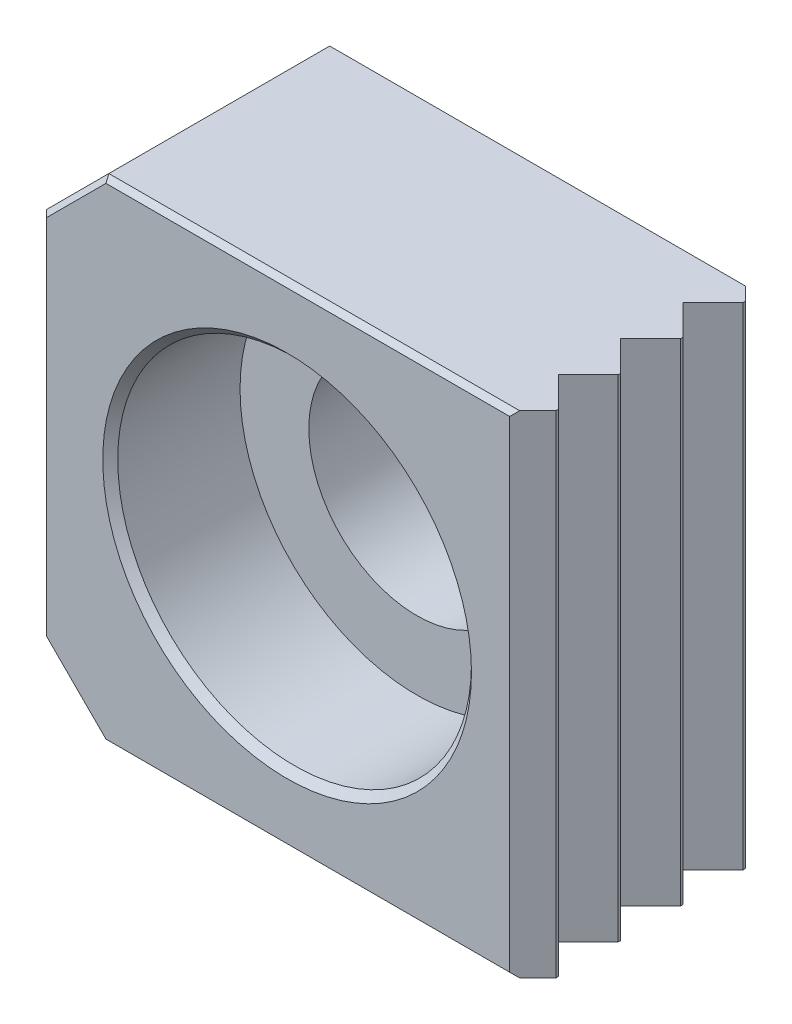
ISO-10303-21;
HEADER;
FILE_DESCRIPTION(('STEP AP214'),'2;1');
FILE_NAME('part.step','',(''),(''),'','','');
FILE_SCHEMA(('AUTOMOTIVE_DESIGN { 1 0 10303 214 1 1 1 1 }'));
ENDSEC;
DATA;
#1=APPLICATION_CONTEXT('core data for automotive mechanical design processes');
#2=APPLICATION_PROTOCOL_DEFINITION('international standard','automotive_design',2000,#1);
#3=PRODUCT_CONTEXT('',#1,'mechanical');
#4=PRODUCT('Part','Part','',(#3));
#5=PRODUCT_RELATED_PRODUCT_CATEGORY('part','',(#4));
#6=PRODUCT_DEFINITION_FORMATION('','',#4);
#7=PRODUCT_DEFINITION_CONTEXT('part definition',#1,'design');
#8=PRODUCT_DEFINITION('design','',#6,#7);
#9=PRODUCT_DEFINITION_SHAPE('','',#8);
#10=(LENGTH_UNIT() NAMED_UNIT(*) SI_UNIT(.MILLI.,.METRE.));
#11=(NAMED_UNIT(*) PLANE_ANGLE_UNIT() SI_UNIT($,.RADIAN.));
#12=(NAMED_UNIT(*) SI_UNIT($,.STERADIAN.) SOLID_ANGLE_UNIT());
#13=UNCERTAINTY_MEASURE_WITH_UNIT(LENGTH_MEASURE(1.E-05),#10,'distance_accuracy_value','');
#14=(GEOMETRIC_REPRESENTATION_CONTEXT(3) GLOBAL_UNCERTAINTY_ASSIGNED_CONTEXT((#13)) GLOBAL_UNIT_ASSIGNED_CONTEXT((#10,
#11,#12)) REPRESENTATION_CONTEXT('',''));
#15=CARTESIAN_POINT('',(0.,0.,0.));
#16=DIRECTION('',(0.,0.,1.));
#17=DIRECTION('',(1.,0.,0.));
#18=AXIS2_PLACEMENT_3D('',#15,#16,#17);
#19=CARTESIAN_POINT('',(12.5,-12.5,12.));
#20=DIRECTION('',(-1.,0.,0.));
#21=DIRECTION('',(0.,-1.,0.));
#22=AXIS2_PLACEMENT_3D('',#19,#20,#21);
#23=PLANE('',#22);
#24=DIRECTION('',(0.,-1.,0.));
#25=VECTOR('',#24,1.);
#26=CARTESIAN_POINT('',(12.5,-12.5,7.524));
#27=LINE('',#26,#25);
#28=CARTESIAN_POINT('',(12.5,12.5,7.524));
#29=VERTEX_POINT('',#28);
#30=CARTESIAN_POINT('',(12.5,-12.5,7.524));
#31=VERTEX_POINT('',#30);
#32=EDGE_CURVE('E249',#29,#31,#27,.T.);
#33=ORIENTED_EDGE('',*,*,#32,.F.);
#34=DIRECTION('',(0.,0.,-1.));
#35=VECTOR('',#34,1.);
#36=CARTESIAN_POINT('',(12.5,12.5,12.));
#37=LINE('',#36,#35);
#38=CARTESIAN_POINT('',(12.5,12.5,7.651));
#39=VERTEX_POINT('',#38);
#40=EDGE_CURVE('E393',#39,#29,#37,.T.);
#41=ORIENTED_EDGE('',*,*,#40,.F.);
#42=DIRECTION('',(0.,1.,0.));
#43=VECTOR('',#42,1.);
#44=CARTESIAN_POINT('',(12.5,-12.5,7.651));
#45=LINE('',#44,#43);
#46=CARTESIAN_POINT('',(12.5,-12.5,7.651));
#47=VERTEX_POINT('',#46);
#48=EDGE_CURVE('E247',#47,#39,#45,.T.);
#49=ORIENTED_EDGE('',*,*,#48,.F.);
#50=DIRECTION('',(0.,0.,-1.));
#51=VECTOR('',#50,1.);
#52=CARTESIAN_POINT('',(12.5,-12.5,12.));
#53=LINE('',#52,#51);
#54=EDGE_CURVE('E373',#47,#31,#53,.T.);
#55=ORIENTED_EDGE('',*,*,#54,.T.);
#56=EDGE_LOOP('',(#33,#41,#49,#55));
#57=FACE_BOUND('',#56,.T.);
#58=ADVANCED_FACE('F15',(#57),#23,.F.);
#59=CARTESIAN_POINT('',(12.5,12.5,4.476));
#60=VERTEX_POINT('',#59);
#61=CARTESIAN_POINT('',(12.5,12.5,4.34900000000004));
#62=VERTEX_POINT('',#61);
#63=EDGE_CURVE('E263',#60,#62,#37,.T.);
#64=ORIENTED_EDGE('',*,*,#63,.F.);
#65=DIRECTION('',(0.,-1.,0.));
#66=VECTOR('',#65,1.);
#67=CARTESIAN_POINT('',(12.5,-12.5,4.476));
#68=LINE('',#67,#66);
#69=CARTESIAN_POINT('',(12.5,-12.5,4.476));
#70=VERTEX_POINT('',#69);
#71=EDGE_CURVE('E251',#60,#70,#68,.T.);
#72=ORIENTED_EDGE('',*,*,#71,.T.);
#73=CARTESIAN_POINT('',(12.5,-12.5,4.34900000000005));
#74=VERTEX_POINT('',#73);
#75=EDGE_CURVE('E258',#70,#74,#53,.T.);
#76=ORIENTED_EDGE('',*,*,#75,.T.);
#77=DIRECTION('',(0.,1.,0.));
#78=VECTOR('',#77,1.);
#79=CARTESIAN_POINT('',(12.5,-12.5,4.34900000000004));
#80=LINE('',#79,#78);
#81=EDGE_CURVE('E177',#74,#62,#80,.T.);
#82=ORIENTED_EDGE('',*,*,#81,.T.);
#83=EDGE_LOOP('',(#64,#72,#76,#82));
#84=FACE_BOUND('',#83,.T.);
#85=ADVANCED_FACE('F350',(#84),#23,.F.);
#86=DIRECTION('',(0.,-1.,0.));
#87=VECTOR('',#86,1.);
#88=CARTESIAN_POINT('',(12.5,-12.5,10.699));
#89=LINE('',#88,#87);
#90=CARTESIAN_POINT('',(12.5,12.5,10.699));
#91=VERTEX_POINT('',#90);
#92=CARTESIAN_POINT('',(12.5,-12.5,10.699));
#93=VERTEX_POINT('',#92);
#94=EDGE_CURVE('E245',#91,#93,#89,.T.);
#95=ORIENTED_EDGE('',*,*,#94,.F.);
#96=CARTESIAN_POINT('',(12.5,12.5,10.826));
#97=VERTEX_POINT('',#96);
#98=EDGE_CURVE('E264',#97,#91,#37,.T.);
#99=ORIENTED_EDGE('',*,*,#98,.F.);
#100=DIRECTION('',(0.,1.,0.));
#101=VECTOR('',#100,1.);
#102=CARTESIAN_POINT('',(12.5,-12.5,10.826));
#103=LINE('',#102,#101);
#104=CARTESIAN_POINT('',(12.5,-12.5,10.826));
#105=VERTEX_POINT('',#104);
#106=EDGE_CURVE('E240',#105,#97,#103,.T.);
#107=ORIENTED_EDGE('',*,*,#106,.F.);
#108=EDGE_CURVE('E259',#105,#93,#53,.T.);
#109=ORIENTED_EDGE('',*,*,#108,.T.);
#110=EDGE_LOOP('',(#95,#99,#107,#109));
#111=FACE_BOUND('',#110,.T.);
#112=ADVANCED_FACE('F356',(#111),#23,.F.);
#113=CARTESIAN_POINT('',(12.5,-12.5,1.30100000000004));
#114=VERTEX_POINT('',#113);
#115=CARTESIAN_POINT('',(12.5,-12.5,1.17400000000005));
#116=VERTEX_POINT('',#115);
#117=EDGE_CURVE('E199',#114,#116,#53,.T.);
#118=ORIENTED_EDGE('',*,*,#117,.T.);
#119=DIRECTION('',(0.,1.,0.));
#120=VECTOR('',#119,1.);
#121=CARTESIAN_POINT('',(12.5,-12.5,1.17400000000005));
#122=LINE('',#121,#120);
#123=CARTESIAN_POINT('',(12.5,12.5,1.17400000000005));
#124=VERTEX_POINT('',#123);
#125=EDGE_CURVE('E236',#116,#124,#122,.T.);
#126=ORIENTED_EDGE('',*,*,#125,.T.);
#127=CARTESIAN_POINT('',(12.5,12.5,1.30100000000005));
#128=VERTEX_POINT('',#127);
#129=EDGE_CURVE('E260',#128,#124,#37,.T.);
#130=ORIENTED_EDGE('',*,*,#129,.F.);
#131=DIRECTION('',(0.,-1.,0.));
#132=VECTOR('',#131,1.);
#133=CARTESIAN_POINT('',(12.5,-12.5,1.30100000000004));
#134=LINE('',#133,#132);
#135=EDGE_CURVE('E243',#128,#114,#134,.T.);
#136=ORIENTED_EDGE('',*,*,#135,.T.);
#137=EDGE_LOOP('',(#118,#126,#130,#136));
#138=FACE_BOUND('',#137,.T.);
#139=ADVANCED_FACE('F352',(#138),#23,.F.);
#140=CARTESIAN_POINT('',(-12.5,12.5,12.));
#141=DIRECTION('',(0.,1.,0.));
#142=DIRECTION('',(-1.,0.,0.));
#143=AXIS2_PLACEMENT_3D('',#140,#141,#142);
#144=PLANE('',#143);
#145=DIRECTION('',(0.,0.,1.));
#146=VECTOR('',#145,1.);
#147=CARTESIAN_POINT('',(-9.325,12.5,12.));
#148=LINE('',#147,#146);
#149=CARTESIAN_POINT('',(-9.325,12.5,0.508));
#150=VERTEX_POINT('',#149);
#151=CARTESIAN_POINT('',(-9.325,12.5,11.746));
#152=VERTEX_POINT('',#151);
#153=EDGE_CURVE('E277',#150,#152,#148,.T.);
#154=ORIENTED_EDGE('',*,*,#153,.T.);
#155=DIRECTION('',(1.,0.,0.));
#156=VECTOR('',#155,1.);
#157=CARTESIAN_POINT('',(-12.5,12.5,11.746));
#158=LINE('',#157,#156);
#159=CARTESIAN_POINT('',(11.58,12.5,11.746));
#160=VERTEX_POINT('',#159);
#161=EDGE_CURVE('E333',#152,#160,#158,.T.);
#162=ORIENTED_EDGE('',*,*,#161,.T.);
#163=DIRECTION('',(-0.707106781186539,0.,0.707106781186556));
#164=VECTOR('',#163,1.);
#165=CARTESIAN_POINT('',(12.5635,12.5,10.7625));
#166=LINE('',#165,#164);
#167=EDGE_CURVE('E226',#97,#160,#166,.T.);
#168=ORIENTED_EDGE('',*,*,#167,.F.);
#169=ORIENTED_EDGE('',*,*,#98,.T.);
#170=DIRECTION('',(0.707106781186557,0.,0.707106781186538));
#171=VECTOR('',#170,1.);
#172=CARTESIAN_POINT('',(10.976,12.5,9.175));
#173=LINE('',#172,#171);
#174=CARTESIAN_POINT('',(10.976,12.5,9.175));
#175=VERTEX_POINT('',#174);
#176=EDGE_CURVE('E229',#175,#91,#173,.T.);
#177=ORIENTED_EDGE('',*,*,#176,.F.);
#178=DIRECTION('',(-0.707106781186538,0.,0.707106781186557));
#179=VECTOR('',#178,1.);
#180=CARTESIAN_POINT('',(12.5635,12.5,7.5875));
#181=LINE('',#180,#179);
#182=EDGE_CURVE('E231',#39,#175,#181,.T.);
#183=ORIENTED_EDGE('',*,*,#182,.F.);
#184=ORIENTED_EDGE('',*,*,#40,.T.);
#185=DIRECTION('',(0.707106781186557,0.,0.707106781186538));
#186=VECTOR('',#185,1.);
#187=CARTESIAN_POINT('',(10.976,12.5,6.));
#188=LINE('',#187,#186);
#189=CARTESIAN_POINT('',(10.976,12.5,6.));
#190=VERTEX_POINT('',#189);
#191=EDGE_CURVE('E192',#190,#29,#188,.T.);
#192=ORIENTED_EDGE('',*,*,#191,.F.);
#193=DIRECTION('',(0.707106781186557,0.,-0.707106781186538));
#194=VECTOR('',#193,1.);
#195=CARTESIAN_POINT('',(10.976,12.5,6.));
#196=LINE('',#195,#194);
#197=EDGE_CURVE('E217',#190,#60,#196,.T.);
#198=ORIENTED_EDGE('',*,*,#197,.T.);
#199=ORIENTED_EDGE('',*,*,#63,.T.);
#200=DIRECTION('',(-0.70710678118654,0.,-0.707106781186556));
#201=VECTOR('',#200,1.);
#202=CARTESIAN_POINT('',(12.5635,12.5,4.41250000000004));
#203=LINE('',#202,#201);
#204=CARTESIAN_POINT('',(10.976,12.5,2.825));
#205=VERTEX_POINT('',#204);
#206=EDGE_CURVE('E220',#62,#205,#203,.T.);
#207=ORIENTED_EDGE('',*,*,#206,.T.);
#208=DIRECTION('',(0.707106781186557,0.,-0.707106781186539));
#209=VECTOR('',#208,1.);
#210=CARTESIAN_POINT('',(10.976,12.5,2.825));
#211=LINE('',#210,#209);
#212=EDGE_CURVE('E189',#205,#128,#211,.T.);
#213=ORIENTED_EDGE('',*,*,#212,.T.);
#214=ORIENTED_EDGE('',*,*,#129,.T.);
#215=DIRECTION('',(-0.707106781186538,0.,-0.707106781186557));
#216=VECTOR('',#215,1.);
#217=CARTESIAN_POINT('',(12.5635,12.5,1.23750000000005));
#218=LINE('',#217,#216);
#219=CARTESIAN_POINT('',(11.834,12.5,0.508));
#220=VERTEX_POINT('',#219);
#221=EDGE_CURVE('E223',#124,#220,#218,.T.);
#222=ORIENTED_EDGE('',*,*,#221,.T.);
#223=DIRECTION('',(-1.,0.,0.));
#224=VECTOR('',#223,1.);
#225=CARTESIAN_POINT('',(-9.325,12.5,0.508));
#226=LINE('',#225,#224);
#227=EDGE_CURVE('E310',#220,#150,#226,.T.);
#228=ORIENTED_EDGE('',*,*,#227,.T.);
#229=EDGE_LOOP('',(#154,#162,#168,#169,#177,#183,#184,#192,#198,#199,#207,#213,#214,#222,#228));
#230=FACE_BOUND('',#229,.T.);
#231=ADVANCED_FACE('F361',(#230),#144,.T.);
#232=CARTESIAN_POINT('',(12.5,-12.5,12.));
#233=DIRECTION('',(0.,-1.,0.));
#234=DIRECTION('',(1.,0.,0.));
#235=AXIS2_PLACEMENT_3D('',#232,#233,#234);
#236=PLANE('',#235);
#237=DIRECTION('',(-0.707106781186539,0.,0.707106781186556));
#238=VECTOR('',#237,1.);
#239=CARTESIAN_POINT('',(12.5635,-12.5,10.7625));
#240=LINE('',#239,#238);
#241=CARTESIAN_POINT('',(11.58,-12.5,11.746));
#242=VERTEX_POINT('',#241);
#243=EDGE_CURVE('E203',#105,#242,#240,.T.);
#244=ORIENTED_EDGE('',*,*,#243,.T.);
#245=DIRECTION('',(-1.,0.,0.));
#246=VECTOR('',#245,1.);
#247=CARTESIAN_POINT('',(12.5,-12.5,11.746));
#248=LINE('',#247,#246);
#249=CARTESIAN_POINT('',(-9.325,-12.5,11.746));
#250=VERTEX_POINT('',#249);
#251=EDGE_CURVE('E312',#242,#250,#248,.T.);
#252=ORIENTED_EDGE('',*,*,#251,.T.);
#253=DIRECTION('',(0.,0.,-1.));
#254=VECTOR('',#253,1.);
#255=CARTESIAN_POINT('',(-9.325,-12.5,0.));
#256=LINE('',#255,#254);
#257=CARTESIAN_POINT('',(-9.325,-12.5,0.508));
#258=VERTEX_POINT('',#257);
#259=EDGE_CURVE('E271',#250,#258,#256,.T.);
#260=ORIENTED_EDGE('',*,*,#259,.T.);
#261=DIRECTION('',(1.,0.,0.));
#262=VECTOR('',#261,1.);
#263=CARTESIAN_POINT('',(11.326,-12.5,0.508));
#264=LINE('',#263,#262);
#265=CARTESIAN_POINT('',(11.834,-12.5,0.508));
#266=VERTEX_POINT('',#265);
#267=EDGE_CURVE('E296',#258,#266,#264,.T.);
#268=ORIENTED_EDGE('',*,*,#267,.T.);
#269=DIRECTION('',(-0.707106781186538,0.,-0.707106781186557));
#270=VECTOR('',#269,1.);
#271=CARTESIAN_POINT('',(12.5635,-12.5,1.23750000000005));
#272=LINE('',#271,#270);
#273=EDGE_CURVE('E200',#116,#266,#272,.T.);
#274=ORIENTED_EDGE('',*,*,#273,.F.);
#275=ORIENTED_EDGE('',*,*,#117,.F.);
#276=DIRECTION('',(0.707106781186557,0.,-0.707106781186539));
#277=VECTOR('',#276,1.);
#278=CARTESIAN_POINT('',(10.976,-12.5,2.825));
#279=LINE('',#278,#277);
#280=CARTESIAN_POINT('',(10.976,-12.5,2.825));
#281=VERTEX_POINT('',#280);
#282=EDGE_CURVE('E182',#281,#114,#279,.T.);
#283=ORIENTED_EDGE('',*,*,#282,.F.);
#284=DIRECTION('',(-0.70710678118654,0.,-0.707106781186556));
#285=VECTOR('',#284,1.);
#286=CARTESIAN_POINT('',(12.5635,-12.5,4.41250000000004));
#287=LINE('',#286,#285);
#288=EDGE_CURVE('E171',#74,#281,#287,.T.);
#289=ORIENTED_EDGE('',*,*,#288,.F.);
#290=ORIENTED_EDGE('',*,*,#75,.F.);
#291=DIRECTION('',(0.707106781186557,0.,-0.707106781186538));
#292=VECTOR('',#291,1.);
#293=CARTESIAN_POINT('',(10.976,-12.5,6.));
#294=LINE('',#293,#292);
#295=CARTESIAN_POINT('',(10.976,-12.5,6.));
#296=VERTEX_POINT('',#295);
#297=EDGE_CURVE('E183',#296,#70,#294,.T.);
#298=ORIENTED_EDGE('',*,*,#297,.F.);
#299=DIRECTION('',(0.707106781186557,0.,0.707106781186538));
#300=VECTOR('',#299,1.);
#301=CARTESIAN_POINT('',(10.976,-12.5,6.));
#302=LINE('',#301,#300);
#303=EDGE_CURVE('E214',#296,#31,#302,.T.);
#304=ORIENTED_EDGE('',*,*,#303,.T.);
#305=ORIENTED_EDGE('',*,*,#54,.F.);
#306=DIRECTION('',(-0.707106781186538,0.,0.707106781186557));
#307=VECTOR('',#306,1.);
#308=CARTESIAN_POINT('',(12.5635,-12.5,7.5875));
#309=LINE('',#308,#307);
#310=CARTESIAN_POINT('',(10.976,-12.5,9.175));
#311=VERTEX_POINT('',#310);
#312=EDGE_CURVE('E211',#47,#311,#309,.T.);
#313=ORIENTED_EDGE('',*,*,#312,.T.);
#314=DIRECTION('',(0.707106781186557,0.,0.707106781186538));
#315=VECTOR('',#314,1.);
#316=CARTESIAN_POINT('',(10.976,-12.5,9.175));
#317=LINE('',#316,#315);
#318=EDGE_CURVE('E208',#311,#93,#317,.T.);
#319=ORIENTED_EDGE('',*,*,#318,.T.);
#320=ORIENTED_EDGE('',*,*,#108,.F.);
#321=EDGE_LOOP('',(#244,#252,#260,#268,#274,#275,#283,#289,#290,#298,#304,#305,#313,#319,#320));
#322=FACE_BOUND('',#321,.T.);
#323=ADVANCED_FACE('F196',(#322),#236,.T.);
#324=CARTESIAN_POINT('',(12.5,-12.5,12.));
#325=DIRECTION('',(0.,0.,1.));
#326=DIRECTION('',(-1.,0.,0.));
#327=AXIS2_PLACEMENT_3D('',#324,#325,#326);
#328=PLANE('',#327);
#329=CARTESIAN_POINT('',(0.,0.,12.));
#330=DIRECTION('',(0.,0.,1.));
#331=DIRECTION('',(1.,0.,0.));
#332=AXIS2_PLACEMENT_3D('',#329,#330,#331);
#333=CIRCLE('',#332,9.381);
#334=CARTESIAN_POINT('',(9.381,0.,12.));
#335=VERTEX_POINT('',#334);
#336=EDGE_CURVE('E9',#335,#335,#333,.F.);
#337=ORIENTED_EDGE('',*,*,#336,.T.);
#338=EDGE_LOOP('',(#337));
#339=FACE_BOUND('',#338,.T.);
#340=DIRECTION('',(0.707106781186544,-0.707106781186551,0.));
#341=VECTOR('',#340,1.);
#342=CARTESIAN_POINT('',(1.76710512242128,-23.2328948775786,12.));
#343=LINE('',#342,#341);
#344=CARTESIAN_POINT('',(-12.246,-9.21978975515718,12.));
#345=VERTEX_POINT('',#344);
#346=CARTESIAN_POINT('',(-9.21978975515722,-12.246,12.));
#347=VERTEX_POINT('',#346);
#348=EDGE_CURVE('E321',#345,#347,#343,.T.);
#349=ORIENTED_EDGE('',*,*,#348,.T.);
#350=DIRECTION('',(1.,0.,0.));
#351=VECTOR('',#350,1.);
#352=CARTESIAN_POINT('',(12.5,-12.246,12.));
#353=LINE('',#352,#351);
#354=CARTESIAN_POINT('',(11.326,-12.246,12.));
#355=VERTEX_POINT('',#354);
#356=EDGE_CURVE('E323',#347,#355,#353,.T.);
#357=ORIENTED_EDGE('',*,*,#356,.T.);
#358=DIRECTION('',(0.,1.,0.));
#359=VECTOR('',#358,1.);
#360=CARTESIAN_POINT('',(11.326,-12.5,12.));
#361=LINE('',#360,#359);
#362=CARTESIAN_POINT('',(11.326,12.246,12.));
#363=VERTEX_POINT('',#362);
#364=EDGE_CURVE('E268',#355,#363,#361,.T.);
#365=ORIENTED_EDGE('',*,*,#364,.T.);
#366=DIRECTION('',(-1.,0.,0.));
#367=VECTOR('',#366,1.);
#368=CARTESIAN_POINT('',(12.5,12.246,12.));
#369=LINE('',#368,#367);
#370=CARTESIAN_POINT('',(-9.21978975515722,12.246,12.));
#371=VERTEX_POINT('',#370);
#372=EDGE_CURVE('E315',#363,#371,#369,.T.);
#373=ORIENTED_EDGE('',*,*,#372,.T.);
#374=DIRECTION('',(-0.707106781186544,-0.707106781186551,0.));
#375=VECTOR('',#374,1.);
#376=CARTESIAN_POINT('',(-10.7328948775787,10.7328948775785,12.));
#377=LINE('',#376,#375);
#378=CARTESIAN_POINT('',(-12.246,9.21978975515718,12.));
#379=VERTEX_POINT('',#378);
#380=EDGE_CURVE('E317',#371,#379,#377,.T.);
#381=ORIENTED_EDGE('',*,*,#380,.T.);
#382=DIRECTION('',(0.,-1.,0.));
#383=VECTOR('',#382,1.);
#384=CARTESIAN_POINT('',(-12.246,-9.325,12.));
#385=LINE('',#384,#383);
#386=EDGE_CURVE('E319',#379,#345,#385,.T.);
#387=ORIENTED_EDGE('',*,*,#386,.T.);
#388=EDGE_LOOP('',(#349,#357,#365,#373,#381,#387));
#389=FACE_BOUND('',#388,.T.);
#390=ADVANCED_FACE('F445',(#339,#389),#328,.T.);
#391=CARTESIAN_POINT('',(-12.5,12.5,12.));
#392=DIRECTION('',(1.,0.,0.));
#393=DIRECTION('',(0.,1.,0.));
#394=AXIS2_PLACEMENT_3D('',#391,#392,#393);
#395=PLANE('',#394);
#396=DIRECTION('',(0.,0.,1.));
#397=VECTOR('',#396,1.);
#398=CARTESIAN_POINT('',(-12.5,-9.325,12.));
#399=LINE('',#398,#397);
#400=CARTESIAN_POINT('',(-12.5,-9.325,0.508));
#401=VERTEX_POINT('',#400);
#402=CARTESIAN_POINT('',(-12.5,-9.325,11.746));
#403=VERTEX_POINT('',#402);
#404=EDGE_CURVE('E275',#401,#403,#399,.T.);
#405=ORIENTED_EDGE('',*,*,#404,.T.);
#406=DIRECTION('',(0.,1.,0.));
#407=VECTOR('',#406,1.);
#408=CARTESIAN_POINT('',(-12.5,9.325,11.746));
#409=LINE('',#408,#407);
#410=CARTESIAN_POINT('',(-12.5,9.325,11.746));
#411=VERTEX_POINT('',#410);
#412=EDGE_CURVE('E38',#403,#411,#409,.T.);
#413=ORIENTED_EDGE('',*,*,#412,.T.);
#414=DIRECTION('',(0.,0.,-1.));
#415=VECTOR('',#414,1.);
#416=CARTESIAN_POINT('',(-12.5,9.325,0.));
#417=LINE('',#416,#415);
#418=CARTESIAN_POINT('',(-12.5,9.325,0.508));
#419=VERTEX_POINT('',#418);
#420=EDGE_CURVE('E273',#411,#419,#417,.T.);
#421=ORIENTED_EDGE('',*,*,#420,.T.);
#422=DIRECTION('',(0.,-1.,0.));
#423=VECTOR('',#422,1.);
#424=CARTESIAN_POINT('',(-12.5,12.5,0.508));
#425=LINE('',#424,#423);
#426=EDGE_CURVE('E305',#419,#401,#425,.T.);
#427=ORIENTED_EDGE('',*,*,#426,.T.);
#428=EDGE_LOOP('',(#405,#413,#421,#427));
#429=FACE_BOUND('',#428,.T.);
#430=ADVANCED_FACE('F439',(#429),#395,.F.);
#431=CARTESIAN_POINT('',(12.5,-12.5,0.));
#432=DIRECTION('',(0.,0.,1.));
#433=DIRECTION('',(-1.,0.,0.));
#434=AXIS2_PLACEMENT_3D('',#431,#432,#433);
#435=PLANE('',#434);
#436=CARTESIAN_POINT('',(0.,0.,0.));
#437=DIRECTION('',(0.,0.,1.));
#438=DIRECTION('',(-1.,0.,0.));
#439=AXIS2_PLACEMENT_3D('',#436,#437,#438);
#440=CIRCLE('',#439,5.881);
#441=CARTESIAN_POINT('',(-5.881,0.,0.));
#442=VERTEX_POINT('',#441);
#443=EDGE_CURVE('E279',#442,#442,#440,.T.);
#444=ORIENTED_EDGE('',*,*,#443,.T.);
#445=EDGE_LOOP('',(#444));
#446=FACE_BOUND('',#445,.T.);
#447=DIRECTION('',(0.,-1.,0.));
#448=VECTOR('',#447,1.);
#449=CARTESIAN_POINT('',(11.326,-12.5,0.));
#450=LINE('',#449,#448);
#451=CARTESIAN_POINT('',(11.326,11.992,0.));
#452=VERTEX_POINT('',#451);
#453=CARTESIAN_POINT('',(11.326,-11.992,0.));
#454=VERTEX_POINT('',#453);
#455=EDGE_CURVE('E265',#452,#454,#450,.T.);
#456=ORIENTED_EDGE('',*,*,#455,.T.);
#457=DIRECTION('',(-1.,0.,0.));
#458=VECTOR('',#457,1.);
#459=CARTESIAN_POINT('',(-9.325,-11.992,0.));
#460=LINE('',#459,#458);
#461=CARTESIAN_POINT('',(-9.11457951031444,-11.992,0.));
#462=VERTEX_POINT('',#461);
#463=EDGE_CURVE('E293',#454,#462,#460,.T.);
#464=ORIENTED_EDGE('',*,*,#463,.T.);
#465=DIRECTION('',(-0.707106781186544,0.707106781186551,0.));
#466=VECTOR('',#465,1.);
#467=CARTESIAN_POINT('',(-12.1407897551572,-8.96578975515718,0.));
#468=LINE('',#467,#466);
#469=CARTESIAN_POINT('',(-11.992,-9.11457951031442,0.));
#470=VERTEX_POINT('',#469);
#471=EDGE_CURVE('E291',#462,#470,#468,.T.);
#472=ORIENTED_EDGE('',*,*,#471,.T.);
#473=DIRECTION('',(0.,1.,0.));
#474=VECTOR('',#473,1.);
#475=CARTESIAN_POINT('',(-11.992,-12.5,0.));
#476=LINE('',#475,#474);
#477=CARTESIAN_POINT('',(-11.992,9.11457951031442,0.));
#478=VERTEX_POINT('',#477);
#479=EDGE_CURVE('E289',#470,#478,#476,.T.);
#480=ORIENTED_EDGE('',*,*,#479,.T.);
#481=DIRECTION('',(0.707106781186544,0.707106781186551,0.));
#482=VECTOR('',#481,1.);
#483=CARTESIAN_POINT('',(-8.96578975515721,12.1407897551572,0.));
#484=LINE('',#483,#482);
#485=CARTESIAN_POINT('',(-9.11457951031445,11.992,0.));
#486=VERTEX_POINT('',#485);
#487=EDGE_CURVE('E287',#478,#486,#484,.T.);
#488=ORIENTED_EDGE('',*,*,#487,.T.);
#489=DIRECTION('',(1.,0.,0.));
#490=VECTOR('',#489,1.);
#491=CARTESIAN_POINT('',(11.326,11.992,0.));
#492=LINE('',#491,#490);
#493=EDGE_CURVE('E285',#486,#452,#492,.T.);
#494=ORIENTED_EDGE('',*,*,#493,.T.);
#495=EDGE_LOOP('',(#456,#464,#472,#480,#488,#494));
#496=FACE_BOUND('',#495,.T.);
#497=ADVANCED_FACE('F429',(#446,#496),#435,.F.);
#498=CARTESIAN_POINT('',(0.,0.,5.396));
#499=DIRECTION('',(0.,0.,1.));
#500=DIRECTION('',(-1.,0.,0.));
#501=AXIS2_PLACEMENT_3D('',#498,#499,#500);
#502=PLANE('',#501);
#503=CARTESIAN_POINT('',(0.,0.,5.396));
#504=DIRECTION('',(0.,0.,1.));
#505=DIRECTION('',(-1.,0.,0.));
#506=AXIS2_PLACEMENT_3D('',#503,#504,#505);
#507=CIRCLE('',#506,5.5);
#508=CARTESIAN_POINT('',(-5.5,0.,5.396));
#509=VERTEX_POINT('',#508);
#510=EDGE_CURVE('E254',#509,#509,#507,.T.);
#511=ORIENTED_EDGE('',*,*,#510,.F.);
#512=EDGE_LOOP('',(#511));
#513=FACE_BOUND('',#512,.T.);
#514=CARTESIAN_POINT('',(0.,0.,5.396));
#515=DIRECTION('',(0.,0.,1.));
#516=DIRECTION('',(1.,0.,0.));
#517=AXIS2_PLACEMENT_3D('',#514,#515,#516);
#518=CIRCLE('',#517,9.);
#519=CARTESIAN_POINT('',(9.,0.,5.396));
#520=VERTEX_POINT('',#519);
#521=EDGE_CURVE('E422',#520,#520,#518,.F.);
#522=ORIENTED_EDGE('',*,*,#521,.F.);
#523=EDGE_LOOP('',(#522));
#524=FACE_BOUND('',#523,.T.);
#525=ADVANCED_FACE('F426',(#513,#524),#502,.T.);
#526=CARTESIAN_POINT('',(0.,0.,0.));
#527=DIRECTION('',(0.,0.,1.));
#528=DIRECTION('',(-1.,0.,0.));
#529=AXIS2_PLACEMENT_3D('',#526,#527,#528);
#530=CYLINDRICAL_SURFACE('',#529,5.5);
#531=CARTESIAN_POINT('',(0.,0.,0.381));
#532=DIRECTION('',(0.,0.,1.));
#533=DIRECTION('',(-1.,0.,0.));
#534=AXIS2_PLACEMENT_3D('',#531,#532,#533);
#535=CIRCLE('',#534,5.5);
#536=CARTESIAN_POINT('',(-5.5,0.,0.381));
#537=VERTEX_POINT('',#536);
#538=EDGE_CURVE('E282',#537,#537,#535,.F.);
#539=ORIENTED_EDGE('',*,*,#538,.T.);
#540=EDGE_LOOP('',(#539));
#541=FACE_BOUND('',#540,.T.);
#542=ORIENTED_EDGE('',*,*,#510,.T.);
#543=EDGE_LOOP('',(#542));
#544=FACE_BOUND('',#543,.T.);
#545=ADVANCED_FACE('F428',(#541,#544),#530,.F.);
#546=CARTESIAN_POINT('',(12.5635,12.5,1.23750000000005));
#547=DIRECTION('',(-0.707106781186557,0.,0.707106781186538));
#548=DIRECTION('',(-0.707106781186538,0.,-0.707106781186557));
#549=AXIS2_PLACEMENT_3D('',#546,#547,#548);
#550=PLANE('',#549);
#551=ORIENTED_EDGE('',*,*,#273,.T.);
#552=DIRECTION('',(-0.577350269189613,0.577350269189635,-0.577350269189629));
#553=VECTOR('',#552,1.);
#554=CARTESIAN_POINT('',(11.7173333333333,-12.3833333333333,0.391333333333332));
#555=LINE('',#554,#553);
#556=EDGE_CURVE('E300',#266,#454,#555,.T.);
#557=ORIENTED_EDGE('',*,*,#556,.T.);
#558=ORIENTED_EDGE('',*,*,#455,.F.);
#559=DIRECTION('',(0.577350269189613,0.577350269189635,0.577350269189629));
#560=VECTOR('',#559,1.);
#561=CARTESIAN_POINT('',(11.7173333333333,12.3833333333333,0.39133333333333));
#562=LINE('',#561,#560);
#563=EDGE_CURVE('E298',#452,#220,#562,.T.);
#564=ORIENTED_EDGE('',*,*,#563,.T.);
#565=ORIENTED_EDGE('',*,*,#221,.F.);
#566=ORIENTED_EDGE('',*,*,#125,.F.);
#567=EDGE_LOOP('',(#551,#557,#558,#564,#565,#566));
#568=FACE_BOUND('',#567,.T.);
#569=ADVANCED_FACE('F436',(#568),#550,.F.);
#570=CARTESIAN_POINT('',(12.5635,12.5,10.7625));
#571=DIRECTION('',(0.707106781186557,0.,0.707106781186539));
#572=DIRECTION('',(-0.707106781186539,0.,0.707106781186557));
#573=AXIS2_PLACEMENT_3D('',#570,#571,#572);
#574=PLANE('',#573);
#575=ORIENTED_EDGE('',*,*,#364,.F.);
#576=DIRECTION('',(-0.577350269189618,0.577350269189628,0.577350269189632));
#577=VECTOR('',#576,1.);
#578=CARTESIAN_POINT('',(3.90233333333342,-4.82233333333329,19.4236666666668));
#579=LINE('',#578,#577);
#580=EDGE_CURVE('E327',#355,#242,#579,.F.);
#581=ORIENTED_EDGE('',*,*,#580,.T.);
#582=ORIENTED_EDGE('',*,*,#243,.F.);
#583=ORIENTED_EDGE('',*,*,#106,.T.);
#584=ORIENTED_EDGE('',*,*,#167,.T.);
#585=DIRECTION('',(0.577350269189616,0.577350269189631,-0.577350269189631));
#586=VECTOR('',#585,1.);
#587=CARTESIAN_POINT('',(12.2356666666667,13.1556666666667,11.0903333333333));
#588=LINE('',#587,#586);
#589=EDGE_CURVE('E325',#160,#363,#588,.F.);
#590=ORIENTED_EDGE('',*,*,#589,.T.);
#591=EDGE_LOOP('',(#575,#581,#582,#583,#584,#590));
#592=FACE_BOUND('',#591,.T.);
#593=ADVANCED_FACE('F474',(#592),#574,.T.);
#594=CARTESIAN_POINT('',(12.5635,12.5,4.41250000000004));
#595=DIRECTION('',(-0.707106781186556,0.,0.707106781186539));
#596=DIRECTION('',(-0.70710678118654,0.,-0.707106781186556));
#597=AXIS2_PLACEMENT_3D('',#594,#595,#596);
#598=PLANE('',#597);
#599=ORIENTED_EDGE('',*,*,#288,.T.);
#600=DIRECTION('',(0.,-1.,0.));
#601=VECTOR('',#600,1.);
#602=CARTESIAN_POINT('',(10.976,12.5,2.825));
#603=LINE('',#602,#601);
#604=EDGE_CURVE('E174',#205,#281,#603,.T.);
#605=ORIENTED_EDGE('',*,*,#604,.F.);
#606=ORIENTED_EDGE('',*,*,#206,.F.);
#607=ORIENTED_EDGE('',*,*,#81,.F.);
#608=EDGE_LOOP('',(#599,#605,#606,#607));
#609=FACE_BOUND('',#608,.T.);
#610=ADVANCED_FACE('F173',(#609),#598,.F.);
#611=CARTESIAN_POINT('',(10.976,12.5,2.825));
#612=DIRECTION('',(-0.707106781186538,0.,-0.707106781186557));
#613=DIRECTION('',(0.707106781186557,0.,-0.707106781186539));
#614=AXIS2_PLACEMENT_3D('',#611,#612,#613);
#615=PLANE('',#614);
#616=ORIENTED_EDGE('',*,*,#212,.F.);
#617=ORIENTED_EDGE('',*,*,#604,.T.);
#618=ORIENTED_EDGE('',*,*,#282,.T.);
#619=ORIENTED_EDGE('',*,*,#135,.F.);
#620=EDGE_LOOP('',(#616,#617,#618,#619));
#621=FACE_BOUND('',#620,.T.);
#622=ADVANCED_FACE('F186',(#621),#615,.F.);
#623=CARTESIAN_POINT('',(10.976,12.5,9.175));
#624=DIRECTION('',(0.707106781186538,0.,-0.707106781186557));
#625=DIRECTION('',(0.707106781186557,0.,0.707106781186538));
#626=AXIS2_PLACEMENT_3D('',#623,#624,#625);
#627=PLANE('',#626);
#628=ORIENTED_EDGE('',*,*,#94,.T.);
#629=ORIENTED_EDGE('',*,*,#318,.F.);
#630=DIRECTION('',(0.,-1.,0.));
#631=VECTOR('',#630,1.);
#632=CARTESIAN_POINT('',(10.976,12.5,9.175));
#633=LINE('',#632,#631);
#634=EDGE_CURVE('E191',#175,#311,#633,.T.);
#635=ORIENTED_EDGE('',*,*,#634,.F.);
#636=ORIENTED_EDGE('',*,*,#176,.T.);
#637=EDGE_LOOP('',(#628,#629,#635,#636));
#638=FACE_BOUND('',#637,.T.);
#639=ADVANCED_FACE('F387',(#638),#627,.T.);
#640=CARTESIAN_POINT('',(12.5635,12.5,7.5875));
#641=DIRECTION('',(0.707106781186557,0.,0.707106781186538));
#642=DIRECTION('',(-0.707106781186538,0.,0.707106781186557));
#643=AXIS2_PLACEMENT_3D('',#640,#641,#642);
#644=PLANE('',#643);
#645=ORIENTED_EDGE('',*,*,#48,.T.);
#646=ORIENTED_EDGE('',*,*,#182,.T.);
#647=ORIENTED_EDGE('',*,*,#634,.T.);
#648=ORIENTED_EDGE('',*,*,#312,.F.);
#649=EDGE_LOOP('',(#645,#646,#647,#648));
#650=FACE_BOUND('',#649,.T.);
#651=ADVANCED_FACE('F527',(#650),#644,.T.);
#652=CARTESIAN_POINT('',(10.976,12.5,6.));
#653=DIRECTION('',(-0.707106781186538,0.,-0.707106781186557));
#654=DIRECTION('',(0.707106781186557,0.,-0.707106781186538));
#655=AXIS2_PLACEMENT_3D('',#652,#653,#654);
#656=PLANE('',#655);
#657=ORIENTED_EDGE('',*,*,#197,.F.);
#658=DIRECTION('',(0.,-1.,0.));
#659=VECTOR('',#658,1.);
#660=CARTESIAN_POINT('',(10.976,12.5,6.));
#661=LINE('',#660,#659);
#662=EDGE_CURVE('E234',#190,#296,#661,.T.);
#663=ORIENTED_EDGE('',*,*,#662,.T.);
#664=ORIENTED_EDGE('',*,*,#297,.T.);
#665=ORIENTED_EDGE('',*,*,#71,.F.);
#666=EDGE_LOOP('',(#657,#663,#664,#665));
#667=FACE_BOUND('',#666,.T.);
#668=ADVANCED_FACE('F526',(#667),#656,.F.);
#669=CARTESIAN_POINT('',(10.976,12.5,6.));
#670=DIRECTION('',(0.707106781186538,0.,-0.707106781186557));
#671=DIRECTION('',(0.707106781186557,0.,0.707106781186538));
#672=AXIS2_PLACEMENT_3D('',#669,#670,#671);
#673=PLANE('',#672);
#674=ORIENTED_EDGE('',*,*,#32,.T.);
#675=ORIENTED_EDGE('',*,*,#303,.F.);
#676=ORIENTED_EDGE('',*,*,#662,.F.);
#677=ORIENTED_EDGE('',*,*,#191,.T.);
#678=EDGE_LOOP('',(#674,#675,#676,#677));
#679=FACE_BOUND('',#678,.T.);
#680=ADVANCED_FACE('F397',(#679),#673,.T.);
#681=CARTESIAN_POINT('',(-9.325,-12.5,12.));
#682=DIRECTION('',(-0.707106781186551,-0.707106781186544,0.));
#683=DIRECTION('',(0.707106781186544,-0.707106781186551,0.));
#684=AXIS2_PLACEMENT_3D('',#681,#682,#683);
#685=PLANE('',#684);
#686=ORIENTED_EDGE('',*,*,#259,.F.);
#687=DIRECTION('',(-0.707106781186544,0.707106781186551,0.));
#688=VECTOR('',#687,1.);
#689=CARTESIAN_POINT('',(-9.325,-12.5,11.746));
#690=LINE('',#689,#688);
#691=EDGE_CURVE('E329',#250,#403,#690,.T.);
#692=ORIENTED_EDGE('',*,*,#691,.T.);
#693=ORIENTED_EDGE('',*,*,#404,.F.);
#694=DIRECTION('',(0.707106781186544,-0.707106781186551,0.));
#695=VECTOR('',#694,1.);
#696=CARTESIAN_POINT('',(-9.325,-12.5,0.508));
#697=LINE('',#696,#695);
#698=EDGE_CURVE('E302',#401,#258,#697,.T.);
#699=ORIENTED_EDGE('',*,*,#698,.T.);
#700=EDGE_LOOP('',(#686,#692,#693,#699));
#701=FACE_BOUND('',#700,.T.);
#702=ADVANCED_FACE('F521',(#701),#685,.T.);
#703=CARTESIAN_POINT('',(-12.5,9.325,12.));
#704=DIRECTION('',(-0.707106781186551,0.707106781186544,0.));
#705=DIRECTION('',(-0.707106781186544,-0.707106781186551,0.));
#706=AXIS2_PLACEMENT_3D('',#703,#704,#705);
#707=PLANE('',#706);
#708=ORIENTED_EDGE('',*,*,#420,.F.);
#709=DIRECTION('',(0.707106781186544,0.707106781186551,0.));
#710=VECTOR('',#709,1.);
#711=CARTESIAN_POINT('',(-12.5,9.325,11.746));
#712=LINE('',#711,#710);
#713=EDGE_CURVE('E30',#411,#152,#712,.T.);
#714=ORIENTED_EDGE('',*,*,#713,.T.);
#715=ORIENTED_EDGE('',*,*,#153,.F.);
#716=DIRECTION('',(-0.707106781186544,-0.707106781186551,0.));
#717=VECTOR('',#716,1.);
#718=CARTESIAN_POINT('',(-12.5,9.325,0.508));
#719=LINE('',#718,#717);
#720=EDGE_CURVE('E307',#150,#419,#719,.T.);
#721=ORIENTED_EDGE('',*,*,#720,.T.);
#722=EDGE_LOOP('',(#708,#714,#715,#721));
#723=FACE_BOUND('',#722,.T.);
#724=ADVANCED_FACE('F517',(#723),#707,.T.);
#725=CARTESIAN_POINT('',(0.,0.,0.));
#726=DIRECTION('',(0.,0.,-1.));
#727=DIRECTION('',(1.,0.,0.));
#728=AXIS2_PLACEMENT_3D('',#725,#726,#727);
#729=CONICAL_SURFACE('',#728,5.881,0.785398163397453);
#730=ORIENTED_EDGE('',*,*,#538,.F.);
#731=EDGE_LOOP('',(#730));
#732=FACE_BOUND('',#731,.T.);
#733=ORIENTED_EDGE('',*,*,#443,.F.);
#734=EDGE_LOOP('',(#733));
#735=FACE_BOUND('',#734,.T.);
#736=ADVANCED_FACE('F513',(#732,#735),#729,.F.);
#737=CARTESIAN_POINT('',(12.5,11.992,0.));
#738=DIRECTION('',(0.,0.707106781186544,-0.707106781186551));
#739=DIRECTION('',(0.,0.707106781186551,0.707106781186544));
#740=AXIS2_PLACEMENT_3D('',#737,#738,#739);
#741=PLANE('',#740);
#742=ORIENTED_EDGE('',*,*,#563,.F.);
#743=ORIENTED_EDGE('',*,*,#493,.F.);
#744=DIRECTION('',(-0.281084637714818,0.678598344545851,0.678598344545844));
#745=VECTOR('',#744,1.);
#746=CARTESIAN_POINT('',(-7.40684241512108,7.86915794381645,-4.1228420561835));
#747=LINE('',#746,#745);
#748=EDGE_CURVE('E399',#150,#486,#747,.F.);
#749=ORIENTED_EDGE('',*,*,#748,.F.);
#750=ORIENTED_EDGE('',*,*,#227,.F.);
#751=EDGE_LOOP('',(#742,#743,#749,#750));
#752=FACE_BOUND('',#751,.T.);
#753=ADVANCED_FACE('F509',(#752),#741,.T.);
#754=CARTESIAN_POINT('',(-10.5532897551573,10.5532897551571,0.));
#755=DIRECTION('',(-0.5,0.5,-0.707106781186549));
#756=DIRECTION('',(0.816496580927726,0.,-0.577350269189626));
#757=AXIS2_PLACEMENT_3D('',#754,#755,#756);
#758=PLANE('',#757);
#759=ORIENTED_EDGE('',*,*,#748,.T.);
#760=ORIENTED_EDGE('',*,*,#487,.F.);
#761=DIRECTION('',(0.678598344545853,-0.281084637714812,-0.678598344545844));
#762=VECTOR('',#761,1.);
#763=CARTESIAN_POINT('',(-11.6039048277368,8.95382522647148,-0.38809517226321));
#764=LINE('',#763,#762);
#765=EDGE_CURVE('E401',#419,#478,#764,.T.);
#766=ORIENTED_EDGE('',*,*,#765,.F.);
#767=ORIENTED_EDGE('',*,*,#720,.F.);
#768=EDGE_LOOP('',(#759,#760,#766,#767));
#769=FACE_BOUND('',#768,.T.);
#770=ADVANCED_FACE('F505',(#769),#758,.T.);
#771=CARTESIAN_POINT('',(-12.5,12.5,0.508));
#772=DIRECTION('',(0.707106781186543,0.,0.707106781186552));
#773=DIRECTION('',(-0.707106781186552,0.,0.707106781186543));
#774=AXIS2_PLACEMENT_3D('',#771,#772,#773);
#775=PLANE('',#774);
#776=ORIENTED_EDGE('',*,*,#765,.T.);
#777=ORIENTED_EDGE('',*,*,#479,.F.);
#778=DIRECTION('',(0.678598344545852,0.281084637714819,-0.678598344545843));
#779=VECTOR('',#778,1.);
#780=CARTESIAN_POINT('',(-8.33702158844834,-7.60063788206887,-3.65497841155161));
#781=LINE('',#780,#779);
#782=EDGE_CURVE('E406',#401,#470,#781,.T.);
#783=ORIENTED_EDGE('',*,*,#782,.F.);
#784=ORIENTED_EDGE('',*,*,#426,.F.);
#785=EDGE_LOOP('',(#776,#777,#783,#784));
#786=FACE_BOUND('',#785,.T.);
#787=ADVANCED_FACE('F501',(#786),#775,.F.);
#788=CARTESIAN_POINT('',(1.94671024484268,-23.0532897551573,0.));
#789=DIRECTION('',(-0.5,-0.5,-0.707106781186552));
#790=DIRECTION('',(0.816496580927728,0.,-0.577350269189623));
#791=AXIS2_PLACEMENT_3D('',#788,#789,#790);
#792=PLANE('',#791);
#793=ORIENTED_EDGE('',*,*,#782,.T.);
#794=ORIENTED_EDGE('',*,*,#471,.F.);
#795=DIRECTION('',(-0.281084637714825,-0.678598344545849,0.678598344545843));
#796=VECTOR('',#795,1.);
#797=CARTESIAN_POINT('',(-10.3505126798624,-14.9758066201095,2.98380662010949));
#798=LINE('',#797,#796);
#799=EDGE_CURVE('E409',#258,#462,#798,.F.);
#800=ORIENTED_EDGE('',*,*,#799,.F.);
#801=ORIENTED_EDGE('',*,*,#698,.F.);
#802=EDGE_LOOP('',(#793,#794,#800,#801));
#803=FACE_BOUND('',#802,.T.);
#804=ADVANCED_FACE('F497',(#803),#792,.T.);
#805=CARTESIAN_POINT('',(12.5,-11.992,0.));
#806=DIRECTION('',(0.,-0.707106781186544,-0.707106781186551));
#807=DIRECTION('',(0.,0.707106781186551,-0.707106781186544));
#808=AXIS2_PLACEMENT_3D('',#805,#806,#807);
#809=PLANE('',#808);
#810=ORIENTED_EDGE('',*,*,#556,.F.);
#811=ORIENTED_EDGE('',*,*,#267,.F.);
#812=ORIENTED_EDGE('',*,*,#799,.T.);
#813=ORIENTED_EDGE('',*,*,#463,.F.);
#814=EDGE_LOOP('',(#810,#811,#812,#813));
#815=FACE_BOUND('',#814,.T.);
#816=ADVANCED_FACE('F491',(#815),#809,.T.);
#817=CARTESIAN_POINT('',(-12.5,12.5,11.746));
#818=DIRECTION('',(0.,-0.707106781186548,-0.707106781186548));
#819=DIRECTION('',(0.,0.707106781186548,-0.707106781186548));
#820=AXIS2_PLACEMENT_3D('',#817,#818,#819);
#821=PLANE('',#820);
#822=ORIENTED_EDGE('',*,*,#589,.F.);
#823=ORIENTED_EDGE('',*,*,#161,.F.);
#824=DIRECTION('',(0.281084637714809,-0.678598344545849,0.678598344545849));
#825=VECTOR('',#824,1.);
#826=CARTESIAN_POINT('',(-9.57585222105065,13.105610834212,11.140389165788));
#827=LINE('',#826,#825);
#828=EDGE_CURVE('E411',#371,#152,#827,.F.);
#829=ORIENTED_EDGE('',*,*,#828,.F.);
#830=ORIENTED_EDGE('',*,*,#372,.F.);
#831=EDGE_LOOP('',(#822,#823,#829,#830));
#832=FACE_BOUND('',#831,.T.);
#833=ADVANCED_FACE('F479',(#832),#821,.F.);
#834=CARTESIAN_POINT('',(-10.7328948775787,10.7328948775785,12.));
#835=DIRECTION('',(0.500000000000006,-0.5,-0.707106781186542));
#836=DIRECTION('',(0.816496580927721,0.,0.577350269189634));
#837=AXIS2_PLACEMENT_3D('',#834,#835,#836);
#838=PLANE('',#837);
#839=ORIENTED_EDGE('',*,*,#828,.T.);
#840=ORIENTED_EDGE('',*,*,#713,.F.);
#841=DIRECTION('',(-0.67859834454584,0.281084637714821,-0.678598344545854));
#842=VECTOR('',#841,1.);
#843=CARTESIAN_POINT('',(-11.8378366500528,9.05072295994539,12.4081633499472));
#844=LINE('',#843,#842);
#845=EDGE_CURVE('E414',#379,#411,#844,.T.);
#846=ORIENTED_EDGE('',*,*,#845,.F.);
#847=ORIENTED_EDGE('',*,*,#380,.F.);
#848=EDGE_LOOP('',(#839,#840,#846,#847));
#849=FACE_BOUND('',#848,.T.);
#850=ADVANCED_FACE('F483',(#849),#838,.F.);
#851=CARTESIAN_POINT('',(-12.246,-12.5,12.));
#852=DIRECTION('',(-0.707106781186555,0.,0.70710678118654));
#853=DIRECTION('',(-0.70710678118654,0.,-0.707106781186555));
#854=AXIS2_PLACEMENT_3D('',#851,#852,#853);
#855=PLANE('',#854);
#856=ORIENTED_EDGE('',*,*,#845,.T.);
#857=ORIENTED_EDGE('',*,*,#412,.F.);
#858=DIRECTION('',(-0.67859834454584,-0.281084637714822,-0.678598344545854));
#859=VECTOR('',#858,1.);
#860=CARTESIAN_POINT('',(-12.871679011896,-9.47895448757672,11.3743209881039));
#861=LINE('',#860,#859);
#862=EDGE_CURVE('E417',#345,#403,#861,.T.);
#863=ORIENTED_EDGE('',*,*,#862,.F.);
#864=ORIENTED_EDGE('',*,*,#386,.F.);
#865=EDGE_LOOP('',(#856,#857,#863,#864));
#866=FACE_BOUND('',#865,.T.);
#867=ADVANCED_FACE('F460',(#866),#855,.T.);
#868=CARTESIAN_POINT('',(1.76710512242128,-23.2328948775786,12.));
#869=DIRECTION('',(0.500000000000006,0.5,-0.707106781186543));
#870=DIRECTION('',(0.816496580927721,0.,0.577350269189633));
#871=AXIS2_PLACEMENT_3D('',#868,#869,#870);
#872=PLANE('',#871);
#873=ORIENTED_EDGE('',*,*,#862,.T.);
#874=ORIENTED_EDGE('',*,*,#691,.F.);
#875=DIRECTION('',(0.281084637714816,0.678598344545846,0.67859834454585));
#876=VECTOR('',#875,1.);
#877=CARTESIAN_POINT('',(-10.4474104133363,-15.2097384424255,9.03626155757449));
#878=LINE('',#877,#876);
#879=EDGE_CURVE('E420',#347,#250,#878,.F.);
#880=ORIENTED_EDGE('',*,*,#879,.F.);
#881=ORIENTED_EDGE('',*,*,#348,.F.);
#882=EDGE_LOOP('',(#873,#874,#880,#881));
#883=FACE_BOUND('',#882,.T.);
#884=ADVANCED_FACE('F466',(#883),#872,.F.);
#885=CARTESIAN_POINT('',(12.5,-12.5,11.746));
#886=DIRECTION('',(0.,0.70710678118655,-0.707106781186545));
#887=DIRECTION('',(0.,0.707106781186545,0.70710678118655));
#888=AXIS2_PLACEMENT_3D('',#885,#886,#887);
#889=PLANE('',#888);
#890=ORIENTED_EDGE('',*,*,#580,.F.);
#891=ORIENTED_EDGE('',*,*,#356,.F.);
#892=ORIENTED_EDGE('',*,*,#879,.T.);
#893=ORIENTED_EDGE('',*,*,#251,.F.);
#894=EDGE_LOOP('',(#890,#891,#892,#893));
#895=FACE_BOUND('',#894,.T.);
#896=ADVANCED_FACE('F346',(#895),#889,.F.);
#897=CARTESIAN_POINT('',(0.,0.,-20.0598441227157));
#898=DIRECTION('',(0.,0.,1.));
#899=DIRECTION('',(1.,0.,0.));
#900=AXIS2_PLACEMENT_3D('',#897,#898,#899);
#901=CYLINDRICAL_SURFACE('',#900,9.);
#902=CARTESIAN_POINT('',(0.,0.,11.619));
#903=DIRECTION('',(0.,0.,1.));
#904=DIRECTION('',(1.,0.,0.));
#905=AXIS2_PLACEMENT_3D('',#902,#903,#904);
#906=CIRCLE('',#905,9.);
#907=CARTESIAN_POINT('',(9.,0.,11.619));
#908=VERTEX_POINT('',#907);
#909=EDGE_CURVE('E23',#908,#908,#906,.T.);
#910=ORIENTED_EDGE('',*,*,#909,.T.);
#911=EDGE_LOOP('',(#910));
#912=FACE_BOUND('',#911,.T.);
#913=ORIENTED_EDGE('',*,*,#521,.T.);
#914=EDGE_LOOP('',(#913));
#915=FACE_BOUND('',#914,.T.);
#916=ADVANCED_FACE('F337',(#912,#915),#901,.F.);
#917=CARTESIAN_POINT('',(0.,0.,11.619));
#918=DIRECTION('',(0.,0.,1.));
#919=DIRECTION('',(1.,0.,0.));
#920=AXIS2_PLACEMENT_3D('',#917,#918,#919);
#921=CONICAL_SURFACE('',#920,9.,0.78539816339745);
#922=ORIENTED_EDGE('',*,*,#336,.F.);
#923=EDGE_LOOP('',(#922));
#924=FACE_BOUND('',#923,.T.);
#925=ORIENTED_EDGE('',*,*,#909,.F.);
#926=EDGE_LOOP('',(#925));
#927=FACE_BOUND('',#926,.T.);
#928=ADVANCED_FACE('F17',(#924,#927),#921,.F.);
#929=CLOSED_SHELL('',(#58,#85,#112,#139,#231,#323,#390,#430,#497,#525,#545,#569,#593,#610,#622,
#639,#651,#668,#680,#702,#724,#736,#753,#770,#787,#804,#816,#833,#850,#867,#884,#896,#916,#928));
#930=MANIFOLD_SOLID_BREP('B1',#929);
#931=ADVANCED_BREP_SHAPE_REPRESENTATION('',(#18,#930),#14);
#932=SHAPE_DEFINITION_REPRESENTATION(#9,#931);
ENDSEC;
END-ISO-10303-21;
